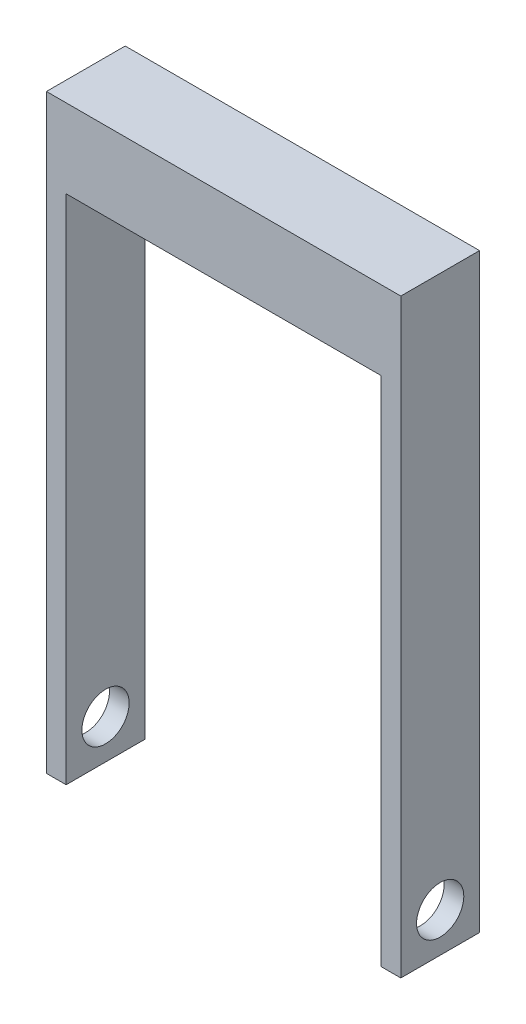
from build123d import *

# Parameters (mm, degrees)
ESTRUSIONE1_DEPTH = 20
SCHIZZO2_R        = 6
ESTRUSIONE2_DEPTH = 177.068168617


with BuildPart() as part:
    # Schizzo1 → Estrusione1 (new body)
    with BuildSketch(Plane.XY):
        Polygon((-45, 0), (-45, 150), (45, 150), (45, 0), (40, 0), (40, 130), (-40, 130), (-40, 0), align=None)
    extrude(amount=ESTRUSIONE1_DEPTH)

    # Schizzo2 → Estrusione2 (cut, through all)
    with BuildSketch(Plane(origin=(45, 0, 0), x_dir=(0, 0, -1), z_dir=(1, 0, 0))):
        with Locations(Location((-10, 10, 0), (0, 0, 90))):
            Circle(SCHIZZO2_R)
    extrude(amount=-ESTRUSIONE2_DEPTH, mode=Mode.SUBTRACT)


solid = part.part
